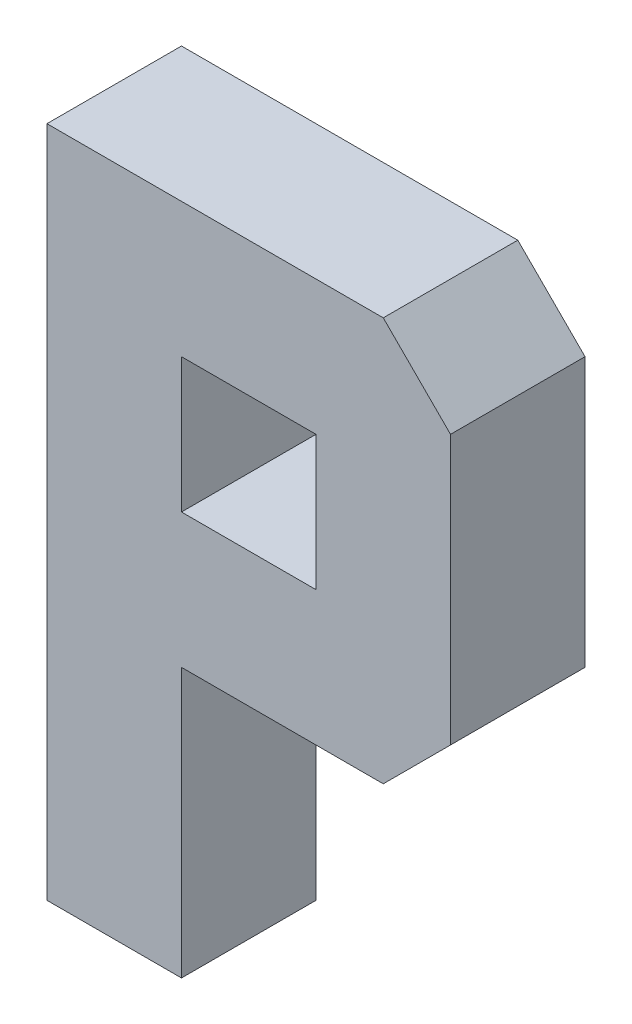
from build123d import *

# Parameters (mm, degrees)
ESQUISSE1_W        = 10
ESQUISSE1_H        = 10
BOSS_EXTRU_1_DEPTH = 10
CHANFREIN1_SIZE    = 5


with BuildPart() as part:
    # Esquisse1 → Boss.-Extru.1 (new body)
    with BuildSketch(Plane.XY):
        Polygon((0, 0), (10, 0), (10, 20), (30, 20), (30, 50), (10, 50), (0, 50), align=None)
        with Locations((15, 35)):
            Rectangle(ESQUISSE1_W, ESQUISSE1_H, mode=Mode.SUBTRACT)
    extrude(amount=BOSS_EXTRU_1_DEPTH)

    # Chanfrein1
    chanfrein1_edges = [part.edges().sort_by_distance(p)[0] for p in [
        (30, 50, 5),
        (30, 20, 5),
    ]]
    chamfer(chanfrein1_edges, length=CHANFREIN1_SIZE)


solid = part.part
